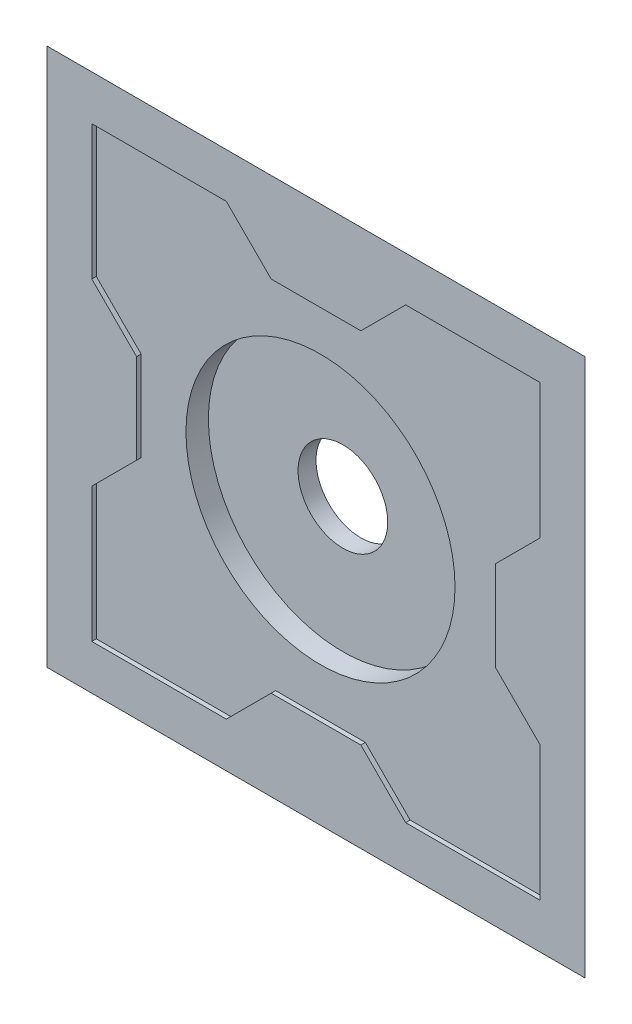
ISO-10303-21;
HEADER;
FILE_DESCRIPTION(('STEP AP214'),'2;1');
FILE_NAME('part.step','',(''),(''),'','','');
FILE_SCHEMA(('AUTOMOTIVE_DESIGN { 1 0 10303 214 1 1 1 1 }'));
ENDSEC;
DATA;
#1=APPLICATION_CONTEXT('core data for automotive mechanical design processes');
#2=APPLICATION_PROTOCOL_DEFINITION('international standard','automotive_design',2000,#1);
#3=PRODUCT_CONTEXT('',#1,'mechanical');
#4=PRODUCT('Part','Part','',(#3));
#5=PRODUCT_RELATED_PRODUCT_CATEGORY('part','',(#4));
#6=PRODUCT_DEFINITION_FORMATION('','',#4);
#7=PRODUCT_DEFINITION_CONTEXT('part definition',#1,'design');
#8=PRODUCT_DEFINITION('design','',#6,#7);
#9=PRODUCT_DEFINITION_SHAPE('','',#8);
#10=(LENGTH_UNIT() NAMED_UNIT(*) SI_UNIT(.MILLI.,.METRE.));
#11=(NAMED_UNIT(*) PLANE_ANGLE_UNIT() SI_UNIT($,.RADIAN.));
#12=(NAMED_UNIT(*) SI_UNIT($,.STERADIAN.) SOLID_ANGLE_UNIT());
#13=UNCERTAINTY_MEASURE_WITH_UNIT(LENGTH_MEASURE(1.E-05),#10,'distance_accuracy_value','');
#14=(GEOMETRIC_REPRESENTATION_CONTEXT(3) GLOBAL_UNCERTAINTY_ASSIGNED_CONTEXT((#13)) GLOBAL_UNIT_ASSIGNED_CONTEXT((#10,
#11,#12)) REPRESENTATION_CONTEXT('',''));
#15=CARTESIAN_POINT('',(0.,0.,0.));
#16=DIRECTION('',(0.,0.,1.));
#17=DIRECTION('',(1.,0.,0.));
#18=AXIS2_PLACEMENT_3D('',#15,#16,#17);
#19=CARTESIAN_POINT('',(0.,0.,10.));
#20=DIRECTION('',(0.,0.,-1.));
#21=DIRECTION('',(-1.,0.,0.));
#22=AXIS2_PLACEMENT_3D('',#19,#20,#21);
#23=PLANE('',#22);
#24=DIRECTION('',(0.707106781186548,-0.707106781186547,0.));
#25=VECTOR('',#24,1.);
#26=CARTESIAN_POINT('',(-50.,20.,10.));
#27=LINE('',#26,#25);
#28=CARTESIAN_POINT('',(-50.,20.,10.));
#29=VERTEX_POINT('',#28);
#30=CARTESIAN_POINT('',(-40.,10.,10.));
#31=VERTEX_POINT('',#30);
#32=EDGE_CURVE('E279',#29,#31,#27,.T.);
#33=ORIENTED_EDGE('',*,*,#32,.F.);
#34=DIRECTION('',(0.,-1.,0.));
#35=VECTOR('',#34,1.);
#36=CARTESIAN_POINT('',(-50.,50.,10.));
#37=LINE('',#36,#35);
#38=CARTESIAN_POINT('',(-50.,50.,10.));
#39=VERTEX_POINT('',#38);
#40=EDGE_CURVE('E202',#39,#29,#37,.T.);
#41=ORIENTED_EDGE('',*,*,#40,.F.);
#42=DIRECTION('',(-1.,0.,0.));
#43=VECTOR('',#42,1.);
#44=CARTESIAN_POINT('',(-50.,50.,10.));
#45=LINE('',#44,#43);
#46=CARTESIAN_POINT('',(-20.,50.,10.));
#47=VERTEX_POINT('',#46);
#48=EDGE_CURVE('E220',#47,#39,#45,.T.);
#49=ORIENTED_EDGE('',*,*,#48,.F.);
#50=DIRECTION('',(-0.707106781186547,0.707106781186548,0.));
#51=VECTOR('',#50,1.);
#52=CARTESIAN_POINT('',(-20.,50.,10.));
#53=LINE('',#52,#51);
#54=CARTESIAN_POINT('',(-10.,40.,10.));
#55=VERTEX_POINT('',#54);
#56=EDGE_CURVE('E223',#55,#47,#53,.T.);
#57=ORIENTED_EDGE('',*,*,#56,.F.);
#58=DIRECTION('',(-1.,0.,0.));
#59=VECTOR('',#58,1.);
#60=CARTESIAN_POINT('',(-10.,40.,10.));
#61=LINE('',#60,#59);
#62=CARTESIAN_POINT('',(9.99999999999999,40.,10.));
#63=VERTEX_POINT('',#62);
#64=EDGE_CURVE('E327',#63,#55,#61,.T.);
#65=ORIENTED_EDGE('',*,*,#64,.F.);
#66=DIRECTION('',(-0.707106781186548,-0.707106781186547,0.));
#67=VECTOR('',#66,1.);
#68=CARTESIAN_POINT('',(9.99999999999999,40.,10.));
#69=LINE('',#68,#67);
#70=CARTESIAN_POINT('',(20.,50.,10.));
#71=VERTEX_POINT('',#70);
#72=EDGE_CURVE('E324',#71,#63,#69,.T.);
#73=ORIENTED_EDGE('',*,*,#72,.F.);
#74=DIRECTION('',(-1.,0.,0.));
#75=VECTOR('',#74,1.);
#76=CARTESIAN_POINT('',(20.,50.,10.));
#77=LINE('',#76,#75);
#78=CARTESIAN_POINT('',(50.,50.,10.));
#79=VERTEX_POINT('',#78);
#80=EDGE_CURVE('E321',#79,#71,#77,.T.);
#81=ORIENTED_EDGE('',*,*,#80,.F.);
#82=DIRECTION('',(0.,1.,0.));
#83=VECTOR('',#82,1.);
#84=CARTESIAN_POINT('',(50.,20.,10.));
#85=LINE('',#84,#83);
#86=CARTESIAN_POINT('',(50.,20.,10.));
#87=VERTEX_POINT('',#86);
#88=EDGE_CURVE('E318',#87,#79,#85,.T.);
#89=ORIENTED_EDGE('',*,*,#88,.F.);
#90=DIRECTION('',(0.707106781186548,0.707106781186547,0.));
#91=VECTOR('',#90,1.);
#92=CARTESIAN_POINT('',(40.,10.,10.));
#93=LINE('',#92,#91);
#94=CARTESIAN_POINT('',(40.,10.,10.));
#95=VERTEX_POINT('',#94);
#96=EDGE_CURVE('E315',#95,#87,#93,.T.);
#97=ORIENTED_EDGE('',*,*,#96,.F.);
#98=DIRECTION('',(0.,1.,0.));
#99=VECTOR('',#98,1.);
#100=CARTESIAN_POINT('',(40.,-10.,10.));
#101=LINE('',#100,#99);
#102=CARTESIAN_POINT('',(40.,-10.,10.));
#103=VERTEX_POINT('',#102);
#104=EDGE_CURVE('E312',#103,#95,#101,.T.);
#105=ORIENTED_EDGE('',*,*,#104,.F.);
#106=DIRECTION('',(-0.707106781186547,0.707106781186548,0.));
#107=VECTOR('',#106,1.);
#108=CARTESIAN_POINT('',(50.,-20.,10.));
#109=LINE('',#108,#107);
#110=CARTESIAN_POINT('',(50.,-20.,10.));
#111=VERTEX_POINT('',#110);
#112=EDGE_CURVE('E309',#111,#103,#109,.T.);
#113=ORIENTED_EDGE('',*,*,#112,.F.);
#114=DIRECTION('',(0.,1.,0.));
#115=VECTOR('',#114,1.);
#116=CARTESIAN_POINT('',(50.,-50.,10.));
#117=LINE('',#116,#115);
#118=CARTESIAN_POINT('',(50.,-50.,10.));
#119=VERTEX_POINT('',#118);
#120=EDGE_CURVE('E306',#119,#111,#117,.T.);
#121=ORIENTED_EDGE('',*,*,#120,.F.);
#122=DIRECTION('',(1.,0.,0.));
#123=VECTOR('',#122,1.);
#124=CARTESIAN_POINT('',(20.,-50.,10.));
#125=LINE('',#124,#123);
#126=CARTESIAN_POINT('',(20.,-50.,10.));
#127=VERTEX_POINT('',#126);
#128=EDGE_CURVE('E303',#127,#119,#125,.T.);
#129=ORIENTED_EDGE('',*,*,#128,.F.);
#130=DIRECTION('',(0.707106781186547,-0.707106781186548,0.));
#131=VECTOR('',#130,1.);
#132=CARTESIAN_POINT('',(9.99999999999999,-40.,10.));
#133=LINE('',#132,#131);
#134=CARTESIAN_POINT('',(9.99999999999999,-40.,10.));
#135=VERTEX_POINT('',#134);
#136=EDGE_CURVE('E300',#135,#127,#133,.T.);
#137=ORIENTED_EDGE('',*,*,#136,.F.);
#138=DIRECTION('',(1.,0.,0.));
#139=VECTOR('',#138,1.);
#140=CARTESIAN_POINT('',(-10.,-40.,10.));
#141=LINE('',#140,#139);
#142=CARTESIAN_POINT('',(-10.,-40.,10.));
#143=VERTEX_POINT('',#142);
#144=EDGE_CURVE('E297',#143,#135,#141,.T.);
#145=ORIENTED_EDGE('',*,*,#144,.F.);
#146=DIRECTION('',(0.707106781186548,0.707106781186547,0.));
#147=VECTOR('',#146,1.);
#148=CARTESIAN_POINT('',(-20.,-50.,10.));
#149=LINE('',#148,#147);
#150=CARTESIAN_POINT('',(-20.,-50.,10.));
#151=VERTEX_POINT('',#150);
#152=EDGE_CURVE('E294',#151,#143,#149,.T.);
#153=ORIENTED_EDGE('',*,*,#152,.F.);
#154=DIRECTION('',(1.,0.,0.));
#155=VECTOR('',#154,1.);
#156=CARTESIAN_POINT('',(-50.,-50.,10.));
#157=LINE('',#156,#155);
#158=CARTESIAN_POINT('',(-50.,-50.,10.));
#159=VERTEX_POINT('',#158);
#160=EDGE_CURVE('E291',#159,#151,#157,.T.);
#161=ORIENTED_EDGE('',*,*,#160,.F.);
#162=DIRECTION('',(0.,-1.,0.));
#163=VECTOR('',#162,1.);
#164=CARTESIAN_POINT('',(-50.,-20.,10.));
#165=LINE('',#164,#163);
#166=CARTESIAN_POINT('',(-50.,-20.,10.));
#167=VERTEX_POINT('',#166);
#168=EDGE_CURVE('E288',#167,#159,#165,.T.);
#169=ORIENTED_EDGE('',*,*,#168,.F.);
#170=DIRECTION('',(-0.707106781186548,-0.707106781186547,0.));
#171=VECTOR('',#170,1.);
#172=CARTESIAN_POINT('',(-40.,-10.,10.));
#173=LINE('',#172,#171);
#174=CARTESIAN_POINT('',(-40.,-10.,10.));
#175=VERTEX_POINT('',#174);
#176=EDGE_CURVE('E285',#175,#167,#173,.T.);
#177=ORIENTED_EDGE('',*,*,#176,.F.);
#178=DIRECTION('',(0.,-1.,0.));
#179=VECTOR('',#178,1.);
#180=CARTESIAN_POINT('',(-40.,10.,10.));
#181=LINE('',#180,#179);
#182=EDGE_CURVE('E282',#31,#175,#181,.T.);
#183=ORIENTED_EDGE('',*,*,#182,.F.);
#184=EDGE_LOOP('',(#33,#41,#49,#57,#65,#73,#81,#89,#97,#105,#113,#121,#129,#137,#145,#153,#161,
#169,#177,#183));
#185=FACE_BOUND('',#184,.T.);
#186=DIRECTION('',(0.,1.,0.));
#187=VECTOR('',#186,1.);
#188=CARTESIAN_POINT('',(60.,-60.,10.));
#189=LINE('',#188,#187);
#190=CARTESIAN_POINT('',(60.,-60.,10.));
#191=VERTEX_POINT('',#190);
#192=CARTESIAN_POINT('',(60.,60.,10.));
#193=VERTEX_POINT('',#192);
#194=EDGE_CURVE('E334',#191,#193,#189,.T.);
#195=ORIENTED_EDGE('',*,*,#194,.T.);
#196=DIRECTION('',(-1.,0.,0.));
#197=VECTOR('',#196,1.);
#198=CARTESIAN_POINT('',(-60.,60.,10.));
#199=LINE('',#198,#197);
#200=CARTESIAN_POINT('',(-60.,60.,10.));
#201=VERTEX_POINT('',#200);
#202=EDGE_CURVE('E372',#193,#201,#199,.T.);
#203=ORIENTED_EDGE('',*,*,#202,.T.);
#204=DIRECTION('',(0.,-1.,0.));
#205=VECTOR('',#204,1.);
#206=CARTESIAN_POINT('',(-60.,-60.,10.));
#207=LINE('',#206,#205);
#208=CARTESIAN_POINT('',(-60.,-60.,10.));
#209=VERTEX_POINT('',#208);
#210=EDGE_CURVE('E374',#201,#209,#207,.T.);
#211=ORIENTED_EDGE('',*,*,#210,.T.);
#212=DIRECTION('',(1.,0.,0.));
#213=VECTOR('',#212,1.);
#214=CARTESIAN_POINT('',(-60.,-60.,10.));
#215=LINE('',#214,#213);
#216=EDGE_CURVE('E376',#209,#191,#215,.T.);
#217=ORIENTED_EDGE('',*,*,#216,.T.);
#218=EDGE_LOOP('',(#195,#203,#211,#217));
#219=FACE_BOUND('',#218,.T.);
#220=ADVANCED_FACE('F32',(#185,#219),#23,.F.);
#221=CARTESIAN_POINT('',(0.,0.,0.));
#222=DIRECTION('',(0.,0.,-1.));
#223=DIRECTION('',(-1.,0.,0.));
#224=AXIS2_PLACEMENT_3D('',#221,#222,#223);
#225=PLANE('',#224);
#226=DIRECTION('',(1.,0.,0.));
#227=VECTOR('',#226,1.);
#228=CARTESIAN_POINT('',(60.,50.,0.));
#229=LINE('',#228,#227);
#230=CARTESIAN_POINT('',(-50.,50.,0.));
#231=VERTEX_POINT('',#230);
#232=CARTESIAN_POINT('',(50.,50.,0.));
#233=VERTEX_POINT('',#232);
#234=EDGE_CURVE('E378',#231,#233,#229,.T.);
#235=ORIENTED_EDGE('',*,*,#234,.T.);
#236=DIRECTION('',(0.,-1.,0.));
#237=VECTOR('',#236,1.);
#238=CARTESIAN_POINT('',(50.,-60.,0.));
#239=LINE('',#238,#237);
#240=CARTESIAN_POINT('',(50.,-50.,0.));
#241=VERTEX_POINT('',#240);
#242=EDGE_CURVE('E11',#233,#241,#239,.T.);
#243=ORIENTED_EDGE('',*,*,#242,.T.);
#244=DIRECTION('',(-1.,0.,0.));
#245=VECTOR('',#244,1.);
#246=CARTESIAN_POINT('',(-60.,-50.,0.));
#247=LINE('',#246,#245);
#248=CARTESIAN_POINT('',(-50.,-50.,0.));
#249=VERTEX_POINT('',#248);
#250=EDGE_CURVE('E41',#241,#249,#247,.T.);
#251=ORIENTED_EDGE('',*,*,#250,.T.);
#252=DIRECTION('',(0.,1.,0.));
#253=VECTOR('',#252,1.);
#254=CARTESIAN_POINT('',(-50.,60.,0.));
#255=LINE('',#254,#253);
#256=EDGE_CURVE('E380',#249,#231,#255,.T.);
#257=ORIENTED_EDGE('',*,*,#256,.T.);
#258=EDGE_LOOP('',(#235,#243,#251,#257));
#259=FACE_BOUND('',#258,.T.);
#260=CARTESIAN_POINT('',(0.,0.,0.));
#261=DIRECTION('',(0.,0.,1.));
#262=DIRECTION('',(1.,0.,0.));
#263=AXIS2_PLACEMENT_3D('',#260,#261,#262);
#264=CIRCLE('',#263,10.);
#265=CARTESIAN_POINT('',(10.,0.,0.));
#266=VERTEX_POINT('',#265);
#267=EDGE_CURVE('E397',#266,#266,#264,.T.);
#268=ORIENTED_EDGE('',*,*,#267,.T.);
#269=EDGE_LOOP('',(#268));
#270=FACE_BOUND('',#269,.T.);
#271=ADVANCED_FACE('F424',(#259,#270),#225,.T.);
#272=CARTESIAN_POINT('',(-50.,50.,9.));
#273=DIRECTION('',(-1.,0.,0.));
#274=DIRECTION('',(0.,0.,1.));
#275=AXIS2_PLACEMENT_3D('',#272,#273,#274);
#276=PLANE('',#275);
#277=ORIENTED_EDGE('',*,*,#40,.T.);
#278=DIRECTION('',(0.,0.,1.));
#279=VECTOR('',#278,1.);
#280=CARTESIAN_POINT('',(-50.,20.,9.));
#281=LINE('',#280,#279);
#282=CARTESIAN_POINT('',(-50.,20.,9.));
#283=VERTEX_POINT('',#282);
#284=EDGE_CURVE('E195',#283,#29,#281,.T.);
#285=ORIENTED_EDGE('',*,*,#284,.F.);
#286=DIRECTION('',(0.,-1.,0.));
#287=VECTOR('',#286,1.);
#288=CARTESIAN_POINT('',(-50.,50.,9.));
#289=LINE('',#288,#287);
#290=CARTESIAN_POINT('',(-50.,50.,9.));
#291=VERTEX_POINT('',#290);
#292=EDGE_CURVE('E199',#291,#283,#289,.T.);
#293=ORIENTED_EDGE('',*,*,#292,.F.);
#294=DIRECTION('',(0.,0.,1.));
#295=VECTOR('',#294,1.);
#296=CARTESIAN_POINT('',(-50.,50.,9.));
#297=LINE('',#296,#295);
#298=EDGE_CURVE('E332',#291,#39,#297,.T.);
#299=ORIENTED_EDGE('',*,*,#298,.T.);
#300=EDGE_LOOP('',(#277,#285,#293,#299));
#301=FACE_BOUND('',#300,.T.);
#302=ADVANCED_FACE('F197',(#301),#276,.F.);
#303=CARTESIAN_POINT('',(-50.,50.,9.));
#304=DIRECTION('',(0.,1.,0.));
#305=DIRECTION('',(0.,0.,1.));
#306=AXIS2_PLACEMENT_3D('',#303,#304,#305);
#307=PLANE('',#306);
#308=ORIENTED_EDGE('',*,*,#48,.T.);
#309=ORIENTED_EDGE('',*,*,#298,.F.);
#310=DIRECTION('',(-1.,0.,0.));
#311=VECTOR('',#310,1.);
#312=CARTESIAN_POINT('',(-50.,50.,9.));
#313=LINE('',#312,#311);
#314=CARTESIAN_POINT('',(-20.,50.,9.));
#315=VERTEX_POINT('',#314);
#316=EDGE_CURVE('E207',#315,#291,#313,.T.);
#317=ORIENTED_EDGE('',*,*,#316,.F.);
#318=DIRECTION('',(0.,0.,1.));
#319=VECTOR('',#318,1.);
#320=CARTESIAN_POINT('',(-20.,50.,9.));
#321=LINE('',#320,#319);
#322=EDGE_CURVE('E335',#315,#47,#321,.T.);
#323=ORIENTED_EDGE('',*,*,#322,.T.);
#324=EDGE_LOOP('',(#308,#309,#317,#323));
#325=FACE_BOUND('',#324,.T.);
#326=ADVANCED_FACE('F646',(#325),#307,.F.);
#327=CARTESIAN_POINT('',(-20.,50.,9.));
#328=DIRECTION('',(0.707106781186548,0.707106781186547,0.));
#329=DIRECTION('',(-0.707106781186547,0.707106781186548,0.));
#330=AXIS2_PLACEMENT_3D('',#327,#328,#329);
#331=PLANE('',#330);
#332=ORIENTED_EDGE('',*,*,#56,.T.);
#333=ORIENTED_EDGE('',*,*,#322,.F.);
#334=DIRECTION('',(-0.707106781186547,0.707106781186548,0.));
#335=VECTOR('',#334,1.);
#336=CARTESIAN_POINT('',(-20.,50.,9.));
#337=LINE('',#336,#335);
#338=CARTESIAN_POINT('',(-10.,40.,9.));
#339=VERTEX_POINT('',#338);
#340=EDGE_CURVE('E275',#339,#315,#337,.T.);
#341=ORIENTED_EDGE('',*,*,#340,.F.);
#342=DIRECTION('',(0.,0.,1.));
#343=VECTOR('',#342,1.);
#344=CARTESIAN_POINT('',(-10.,40.,9.));
#345=LINE('',#344,#343);
#346=EDGE_CURVE('E337',#339,#55,#345,.T.);
#347=ORIENTED_EDGE('',*,*,#346,.T.);
#348=EDGE_LOOP('',(#332,#333,#341,#347));
#349=FACE_BOUND('',#348,.T.);
#350=ADVANCED_FACE('F636',(#349),#331,.F.);
#351=CARTESIAN_POINT('',(-10.,40.,9.));
#352=DIRECTION('',(0.,1.,0.));
#353=DIRECTION('',(-1.,0.,0.));
#354=AXIS2_PLACEMENT_3D('',#351,#352,#353);
#355=PLANE('',#354);
#356=ORIENTED_EDGE('',*,*,#64,.T.);
#357=ORIENTED_EDGE('',*,*,#346,.F.);
#358=DIRECTION('',(-1.,0.,0.));
#359=VECTOR('',#358,1.);
#360=CARTESIAN_POINT('',(-10.,40.,9.));
#361=LINE('',#360,#359);
#362=CARTESIAN_POINT('',(9.99999999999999,40.,9.));
#363=VERTEX_POINT('',#362);
#364=EDGE_CURVE('E272',#363,#339,#361,.T.);
#365=ORIENTED_EDGE('',*,*,#364,.F.);
#366=DIRECTION('',(0.,0.,1.));
#367=VECTOR('',#366,1.);
#368=CARTESIAN_POINT('',(9.99999999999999,40.,9.));
#369=LINE('',#368,#367);
#370=EDGE_CURVE('E339',#363,#63,#369,.T.);
#371=ORIENTED_EDGE('',*,*,#370,.T.);
#372=EDGE_LOOP('',(#356,#357,#365,#371));
#373=FACE_BOUND('',#372,.T.);
#374=ADVANCED_FACE('F626',(#373),#355,.F.);
#375=CARTESIAN_POINT('',(9.99999999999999,40.,9.));
#376=DIRECTION('',(-0.707106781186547,0.707106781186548,0.));
#377=DIRECTION('',(-0.707106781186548,-0.707106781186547,0.));
#378=AXIS2_PLACEMENT_3D('',#375,#376,#377);
#379=PLANE('',#378);
#380=ORIENTED_EDGE('',*,*,#72,.T.);
#381=ORIENTED_EDGE('',*,*,#370,.F.);
#382=DIRECTION('',(-0.707106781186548,-0.707106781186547,0.));
#383=VECTOR('',#382,1.);
#384=CARTESIAN_POINT('',(9.99999999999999,40.,9.));
#385=LINE('',#384,#383);
#386=CARTESIAN_POINT('',(20.,50.,9.));
#387=VERTEX_POINT('',#386);
#388=EDGE_CURVE('E269',#387,#363,#385,.T.);
#389=ORIENTED_EDGE('',*,*,#388,.F.);
#390=DIRECTION('',(0.,0.,1.));
#391=VECTOR('',#390,1.);
#392=CARTESIAN_POINT('',(20.,50.,9.));
#393=LINE('',#392,#391);
#394=EDGE_CURVE('E341',#387,#71,#393,.T.);
#395=ORIENTED_EDGE('',*,*,#394,.T.);
#396=EDGE_LOOP('',(#380,#381,#389,#395));
#397=FACE_BOUND('',#396,.T.);
#398=ADVANCED_FACE('F616',(#397),#379,.F.);
#399=CARTESIAN_POINT('',(20.,50.,9.));
#400=DIRECTION('',(0.,1.,0.));
#401=DIRECTION('',(-1.,0.,0.));
#402=AXIS2_PLACEMENT_3D('',#399,#400,#401);
#403=PLANE('',#402);
#404=ORIENTED_EDGE('',*,*,#80,.T.);
#405=ORIENTED_EDGE('',*,*,#394,.F.);
#406=DIRECTION('',(-1.,0.,0.));
#407=VECTOR('',#406,1.);
#408=CARTESIAN_POINT('',(20.,50.,9.));
#409=LINE('',#408,#407);
#410=CARTESIAN_POINT('',(50.,50.,9.));
#411=VERTEX_POINT('',#410);
#412=EDGE_CURVE('E266',#411,#387,#409,.T.);
#413=ORIENTED_EDGE('',*,*,#412,.F.);
#414=DIRECTION('',(0.,0.,1.));
#415=VECTOR('',#414,1.);
#416=CARTESIAN_POINT('',(50.,50.,9.));
#417=LINE('',#416,#415);
#418=EDGE_CURVE('E343',#411,#79,#417,.T.);
#419=ORIENTED_EDGE('',*,*,#418,.T.);
#420=EDGE_LOOP('',(#404,#405,#413,#419));
#421=FACE_BOUND('',#420,.T.);
#422=ADVANCED_FACE('F606',(#421),#403,.F.);
#423=CARTESIAN_POINT('',(50.,20.,9.));
#424=DIRECTION('',(1.,0.,0.));
#425=DIRECTION('',(0.,0.,-1.));
#426=AXIS2_PLACEMENT_3D('',#423,#424,#425);
#427=PLANE('',#426);
#428=ORIENTED_EDGE('',*,*,#88,.T.);
#429=ORIENTED_EDGE('',*,*,#418,.F.);
#430=DIRECTION('',(0.,1.,0.));
#431=VECTOR('',#430,1.);
#432=CARTESIAN_POINT('',(50.,20.,9.));
#433=LINE('',#432,#431);
#434=CARTESIAN_POINT('',(50.,20.,9.));
#435=VERTEX_POINT('',#434);
#436=EDGE_CURVE('E263',#435,#411,#433,.T.);
#437=ORIENTED_EDGE('',*,*,#436,.F.);
#438=DIRECTION('',(0.,0.,1.));
#439=VECTOR('',#438,1.);
#440=CARTESIAN_POINT('',(50.,20.,9.));
#441=LINE('',#440,#439);
#442=EDGE_CURVE('E345',#435,#87,#441,.T.);
#443=ORIENTED_EDGE('',*,*,#442,.T.);
#444=EDGE_LOOP('',(#428,#429,#437,#443));
#445=FACE_BOUND('',#444,.T.);
#446=ADVANCED_FACE('F596',(#445),#427,.F.);
#447=CARTESIAN_POINT('',(40.,10.,9.));
#448=DIRECTION('',(0.707106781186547,-0.707106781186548,0.));
#449=DIRECTION('',(0.707106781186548,0.707106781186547,0.));
#450=AXIS2_PLACEMENT_3D('',#447,#448,#449);
#451=PLANE('',#450);
#452=ORIENTED_EDGE('',*,*,#96,.T.);
#453=ORIENTED_EDGE('',*,*,#442,.F.);
#454=DIRECTION('',(0.707106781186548,0.707106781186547,0.));
#455=VECTOR('',#454,1.);
#456=CARTESIAN_POINT('',(40.,10.,9.));
#457=LINE('',#456,#455);
#458=CARTESIAN_POINT('',(40.,10.,9.));
#459=VERTEX_POINT('',#458);
#460=EDGE_CURVE('E260',#459,#435,#457,.T.);
#461=ORIENTED_EDGE('',*,*,#460,.F.);
#462=DIRECTION('',(0.,0.,1.));
#463=VECTOR('',#462,1.);
#464=CARTESIAN_POINT('',(40.,10.,9.));
#465=LINE('',#464,#463);
#466=EDGE_CURVE('E347',#459,#95,#465,.T.);
#467=ORIENTED_EDGE('',*,*,#466,.T.);
#468=EDGE_LOOP('',(#452,#453,#461,#467));
#469=FACE_BOUND('',#468,.T.);
#470=ADVANCED_FACE('F586',(#469),#451,.F.);
#471=CARTESIAN_POINT('',(40.,-10.,9.));
#472=DIRECTION('',(1.,0.,0.));
#473=DIRECTION('',(0.,0.,-1.));
#474=AXIS2_PLACEMENT_3D('',#471,#472,#473);
#475=PLANE('',#474);
#476=ORIENTED_EDGE('',*,*,#104,.T.);
#477=ORIENTED_EDGE('',*,*,#466,.F.);
#478=DIRECTION('',(0.,1.,0.));
#479=VECTOR('',#478,1.);
#480=CARTESIAN_POINT('',(40.,-10.,9.));
#481=LINE('',#480,#479);
#482=CARTESIAN_POINT('',(40.,-10.,9.));
#483=VERTEX_POINT('',#482);
#484=EDGE_CURVE('E257',#483,#459,#481,.T.);
#485=ORIENTED_EDGE('',*,*,#484,.F.);
#486=DIRECTION('',(0.,0.,1.));
#487=VECTOR('',#486,1.);
#488=CARTESIAN_POINT('',(40.,-10.,9.));
#489=LINE('',#488,#487);
#490=EDGE_CURVE('E349',#483,#103,#489,.T.);
#491=ORIENTED_EDGE('',*,*,#490,.T.);
#492=EDGE_LOOP('',(#476,#477,#485,#491));
#493=FACE_BOUND('',#492,.T.);
#494=ADVANCED_FACE('F576',(#493),#475,.F.);
#495=CARTESIAN_POINT('',(50.,-20.,9.));
#496=DIRECTION('',(0.707106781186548,0.707106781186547,0.));
#497=DIRECTION('',(-0.707106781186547,0.707106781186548,0.));
#498=AXIS2_PLACEMENT_3D('',#495,#496,#497);
#499=PLANE('',#498);
#500=ORIENTED_EDGE('',*,*,#112,.T.);
#501=ORIENTED_EDGE('',*,*,#490,.F.);
#502=DIRECTION('',(-0.707106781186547,0.707106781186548,0.));
#503=VECTOR('',#502,1.);
#504=CARTESIAN_POINT('',(50.,-20.,9.));
#505=LINE('',#504,#503);
#506=CARTESIAN_POINT('',(50.,-20.,9.));
#507=VERTEX_POINT('',#506);
#508=EDGE_CURVE('E254',#507,#483,#505,.T.);
#509=ORIENTED_EDGE('',*,*,#508,.F.);
#510=DIRECTION('',(0.,0.,1.));
#511=VECTOR('',#510,1.);
#512=CARTESIAN_POINT('',(50.,-20.,9.));
#513=LINE('',#512,#511);
#514=EDGE_CURVE('E351',#507,#111,#513,.T.);
#515=ORIENTED_EDGE('',*,*,#514,.T.);
#516=EDGE_LOOP('',(#500,#501,#509,#515));
#517=FACE_BOUND('',#516,.T.);
#518=ADVANCED_FACE('F566',(#517),#499,.F.);
#519=CARTESIAN_POINT('',(50.,-50.,9.));
#520=DIRECTION('',(1.,0.,0.));
#521=DIRECTION('',(0.,0.,-1.));
#522=AXIS2_PLACEMENT_3D('',#519,#520,#521);
#523=PLANE('',#522);
#524=ORIENTED_EDGE('',*,*,#120,.T.);
#525=ORIENTED_EDGE('',*,*,#514,.F.);
#526=DIRECTION('',(0.,1.,0.));
#527=VECTOR('',#526,1.);
#528=CARTESIAN_POINT('',(50.,-50.,9.));
#529=LINE('',#528,#527);
#530=CARTESIAN_POINT('',(50.,-50.,9.));
#531=VERTEX_POINT('',#530);
#532=EDGE_CURVE('E251',#531,#507,#529,.T.);
#533=ORIENTED_EDGE('',*,*,#532,.F.);
#534=DIRECTION('',(0.,0.,1.));
#535=VECTOR('',#534,1.);
#536=CARTESIAN_POINT('',(50.,-50.,9.));
#537=LINE('',#536,#535);
#538=EDGE_CURVE('E353',#531,#119,#537,.T.);
#539=ORIENTED_EDGE('',*,*,#538,.T.);
#540=EDGE_LOOP('',(#524,#525,#533,#539));
#541=FACE_BOUND('',#540,.T.);
#542=ADVANCED_FACE('F556',(#541),#523,.F.);
#543=CARTESIAN_POINT('',(20.,-50.,9.));
#544=DIRECTION('',(0.,-1.,0.));
#545=DIRECTION('',(0.,0.,-1.));
#546=AXIS2_PLACEMENT_3D('',#543,#544,#545);
#547=PLANE('',#546);
#548=ORIENTED_EDGE('',*,*,#128,.T.);
#549=ORIENTED_EDGE('',*,*,#538,.F.);
#550=DIRECTION('',(1.,0.,0.));
#551=VECTOR('',#550,1.);
#552=CARTESIAN_POINT('',(20.,-50.,9.));
#553=LINE('',#552,#551);
#554=CARTESIAN_POINT('',(20.,-50.,9.));
#555=VERTEX_POINT('',#554);
#556=EDGE_CURVE('E248',#555,#531,#553,.T.);
#557=ORIENTED_EDGE('',*,*,#556,.F.);
#558=DIRECTION('',(0.,0.,1.));
#559=VECTOR('',#558,1.);
#560=CARTESIAN_POINT('',(20.,-50.,9.));
#561=LINE('',#560,#559);
#562=EDGE_CURVE('E355',#555,#127,#561,.T.);
#563=ORIENTED_EDGE('',*,*,#562,.T.);
#564=EDGE_LOOP('',(#548,#549,#557,#563));
#565=FACE_BOUND('',#564,.T.);
#566=ADVANCED_FACE('F546',(#565),#547,.F.);
#567=CARTESIAN_POINT('',(9.99999999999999,-40.,9.));
#568=DIRECTION('',(-0.707106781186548,-0.707106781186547,0.));
#569=DIRECTION('',(0.707106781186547,-0.707106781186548,0.));
#570=AXIS2_PLACEMENT_3D('',#567,#568,#569);
#571=PLANE('',#570);
#572=ORIENTED_EDGE('',*,*,#136,.T.);
#573=ORIENTED_EDGE('',*,*,#562,.F.);
#574=DIRECTION('',(0.707106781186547,-0.707106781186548,0.));
#575=VECTOR('',#574,1.);
#576=CARTESIAN_POINT('',(9.99999999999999,-40.,9.));
#577=LINE('',#576,#575);
#578=CARTESIAN_POINT('',(9.99999999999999,-40.,9.));
#579=VERTEX_POINT('',#578);
#580=EDGE_CURVE('E245',#579,#555,#577,.T.);
#581=ORIENTED_EDGE('',*,*,#580,.F.);
#582=DIRECTION('',(0.,0.,1.));
#583=VECTOR('',#582,1.);
#584=CARTESIAN_POINT('',(9.99999999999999,-40.,9.));
#585=LINE('',#584,#583);
#586=EDGE_CURVE('E357',#579,#135,#585,.T.);
#587=ORIENTED_EDGE('',*,*,#586,.T.);
#588=EDGE_LOOP('',(#572,#573,#581,#587));
#589=FACE_BOUND('',#588,.T.);
#590=ADVANCED_FACE('F536',(#589),#571,.F.);
#591=CARTESIAN_POINT('',(-10.,-40.,9.));
#592=DIRECTION('',(0.,-1.,0.));
#593=DIRECTION('',(0.,0.,-1.));
#594=AXIS2_PLACEMENT_3D('',#591,#592,#593);
#595=PLANE('',#594);
#596=ORIENTED_EDGE('',*,*,#144,.T.);
#597=ORIENTED_EDGE('',*,*,#586,.F.);
#598=DIRECTION('',(1.,0.,0.));
#599=VECTOR('',#598,1.);
#600=CARTESIAN_POINT('',(-10.,-40.,9.));
#601=LINE('',#600,#599);
#602=CARTESIAN_POINT('',(-10.,-40.,9.));
#603=VERTEX_POINT('',#602);
#604=EDGE_CURVE('E242',#603,#579,#601,.T.);
#605=ORIENTED_EDGE('',*,*,#604,.F.);
#606=DIRECTION('',(0.,0.,1.));
#607=VECTOR('',#606,1.);
#608=CARTESIAN_POINT('',(-10.,-40.,9.));
#609=LINE('',#608,#607);
#610=EDGE_CURVE('E359',#603,#143,#609,.T.);
#611=ORIENTED_EDGE('',*,*,#610,.T.);
#612=EDGE_LOOP('',(#596,#597,#605,#611));
#613=FACE_BOUND('',#612,.T.);
#614=ADVANCED_FACE('F526',(#613),#595,.F.);
#615=CARTESIAN_POINT('',(-20.,-50.,9.));
#616=DIRECTION('',(0.707106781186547,-0.707106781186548,0.));
#617=DIRECTION('',(0.707106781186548,0.707106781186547,0.));
#618=AXIS2_PLACEMENT_3D('',#615,#616,#617);
#619=PLANE('',#618);
#620=ORIENTED_EDGE('',*,*,#152,.T.);
#621=ORIENTED_EDGE('',*,*,#610,.F.);
#622=DIRECTION('',(0.707106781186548,0.707106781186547,0.));
#623=VECTOR('',#622,1.);
#624=CARTESIAN_POINT('',(-20.,-50.,9.));
#625=LINE('',#624,#623);
#626=CARTESIAN_POINT('',(-20.,-50.,9.));
#627=VERTEX_POINT('',#626);
#628=EDGE_CURVE('E239',#627,#603,#625,.T.);
#629=ORIENTED_EDGE('',*,*,#628,.F.);
#630=DIRECTION('',(0.,0.,1.));
#631=VECTOR('',#630,1.);
#632=CARTESIAN_POINT('',(-20.,-50.,9.));
#633=LINE('',#632,#631);
#634=EDGE_CURVE('E361',#627,#151,#633,.T.);
#635=ORIENTED_EDGE('',*,*,#634,.T.);
#636=EDGE_LOOP('',(#620,#621,#629,#635));
#637=FACE_BOUND('',#636,.T.);
#638=ADVANCED_FACE('F516',(#637),#619,.F.);
#639=CARTESIAN_POINT('',(-50.,-50.,9.));
#640=DIRECTION('',(0.,-1.,0.));
#641=DIRECTION('',(0.,0.,-1.));
#642=AXIS2_PLACEMENT_3D('',#639,#640,#641);
#643=PLANE('',#642);
#644=ORIENTED_EDGE('',*,*,#160,.T.);
#645=ORIENTED_EDGE('',*,*,#634,.F.);
#646=DIRECTION('',(1.,0.,0.));
#647=VECTOR('',#646,1.);
#648=CARTESIAN_POINT('',(-50.,-50.,9.));
#649=LINE('',#648,#647);
#650=CARTESIAN_POINT('',(-50.,-50.,9.));
#651=VERTEX_POINT('',#650);
#652=EDGE_CURVE('E236',#651,#627,#649,.T.);
#653=ORIENTED_EDGE('',*,*,#652,.F.);
#654=DIRECTION('',(0.,0.,1.));
#655=VECTOR('',#654,1.);
#656=CARTESIAN_POINT('',(-50.,-50.,9.));
#657=LINE('',#656,#655);
#658=EDGE_CURVE('E363',#651,#159,#657,.T.);
#659=ORIENTED_EDGE('',*,*,#658,.T.);
#660=EDGE_LOOP('',(#644,#645,#653,#659));
#661=FACE_BOUND('',#660,.T.);
#662=ADVANCED_FACE('F506',(#661),#643,.F.);
#663=CARTESIAN_POINT('',(-50.,-20.,9.));
#664=DIRECTION('',(-1.,0.,0.));
#665=DIRECTION('',(0.,0.,1.));
#666=AXIS2_PLACEMENT_3D('',#663,#664,#665);
#667=PLANE('',#666);
#668=ORIENTED_EDGE('',*,*,#168,.T.);
#669=ORIENTED_EDGE('',*,*,#658,.F.);
#670=DIRECTION('',(0.,-1.,0.));
#671=VECTOR('',#670,1.);
#672=CARTESIAN_POINT('',(-50.,-20.,9.));
#673=LINE('',#672,#671);
#674=CARTESIAN_POINT('',(-50.,-20.,9.));
#675=VERTEX_POINT('',#674);
#676=EDGE_CURVE('E233',#675,#651,#673,.T.);
#677=ORIENTED_EDGE('',*,*,#676,.F.);
#678=DIRECTION('',(0.,0.,1.));
#679=VECTOR('',#678,1.);
#680=CARTESIAN_POINT('',(-50.,-20.,9.));
#681=LINE('',#680,#679);
#682=EDGE_CURVE('E365',#675,#167,#681,.T.);
#683=ORIENTED_EDGE('',*,*,#682,.T.);
#684=EDGE_LOOP('',(#668,#669,#677,#683));
#685=FACE_BOUND('',#684,.T.);
#686=ADVANCED_FACE('F496',(#685),#667,.F.);
#687=CARTESIAN_POINT('',(-40.,-10.,9.));
#688=DIRECTION('',(-0.707106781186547,0.707106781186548,0.));
#689=DIRECTION('',(-0.707106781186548,-0.707106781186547,0.));
#690=AXIS2_PLACEMENT_3D('',#687,#688,#689);
#691=PLANE('',#690);
#692=ORIENTED_EDGE('',*,*,#176,.T.);
#693=ORIENTED_EDGE('',*,*,#682,.F.);
#694=DIRECTION('',(-0.707106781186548,-0.707106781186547,0.));
#695=VECTOR('',#694,1.);
#696=CARTESIAN_POINT('',(-40.,-10.,9.));
#697=LINE('',#696,#695);
#698=CARTESIAN_POINT('',(-40.,-10.,9.));
#699=VERTEX_POINT('',#698);
#700=EDGE_CURVE('E230',#699,#675,#697,.T.);
#701=ORIENTED_EDGE('',*,*,#700,.F.);
#702=DIRECTION('',(0.,0.,1.));
#703=VECTOR('',#702,1.);
#704=CARTESIAN_POINT('',(-40.,-10.,9.));
#705=LINE('',#704,#703);
#706=EDGE_CURVE('E367',#699,#175,#705,.T.);
#707=ORIENTED_EDGE('',*,*,#706,.T.);
#708=EDGE_LOOP('',(#692,#693,#701,#707));
#709=FACE_BOUND('',#708,.T.);
#710=ADVANCED_FACE('F486',(#709),#691,.F.);
#711=CARTESIAN_POINT('',(-40.,10.,9.));
#712=DIRECTION('',(-1.,0.,0.));
#713=DIRECTION('',(0.,0.,1.));
#714=AXIS2_PLACEMENT_3D('',#711,#712,#713);
#715=PLANE('',#714);
#716=ORIENTED_EDGE('',*,*,#182,.T.);
#717=ORIENTED_EDGE('',*,*,#706,.F.);
#718=DIRECTION('',(0.,-1.,0.));
#719=VECTOR('',#718,1.);
#720=CARTESIAN_POINT('',(-40.,10.,9.));
#721=LINE('',#720,#719);
#722=CARTESIAN_POINT('',(-40.,10.,9.));
#723=VERTEX_POINT('',#722);
#724=EDGE_CURVE('E215',#723,#699,#721,.T.);
#725=ORIENTED_EDGE('',*,*,#724,.F.);
#726=DIRECTION('',(0.,0.,1.));
#727=VECTOR('',#726,1.);
#728=CARTESIAN_POINT('',(-40.,10.,9.));
#729=LINE('',#728,#727);
#730=EDGE_CURVE('E206',#723,#31,#729,.T.);
#731=ORIENTED_EDGE('',*,*,#730,.T.);
#732=EDGE_LOOP('',(#716,#717,#725,#731));
#733=FACE_BOUND('',#732,.T.);
#734=ADVANCED_FACE('F420',(#733),#715,.F.);
#735=CARTESIAN_POINT('',(-50.,20.,9.));
#736=DIRECTION('',(-0.707106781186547,-0.707106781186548,0.));
#737=DIRECTION('',(0.707106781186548,-0.707106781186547,0.));
#738=AXIS2_PLACEMENT_3D('',#735,#736,#737);
#739=PLANE('',#738);
#740=ORIENTED_EDGE('',*,*,#32,.T.);
#741=ORIENTED_EDGE('',*,*,#730,.F.);
#742=DIRECTION('',(0.707106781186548,-0.707106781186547,0.));
#743=VECTOR('',#742,1.);
#744=CARTESIAN_POINT('',(-50.,20.,9.));
#745=LINE('',#744,#743);
#746=EDGE_CURVE('E210',#283,#723,#745,.T.);
#747=ORIENTED_EDGE('',*,*,#746,.F.);
#748=ORIENTED_EDGE('',*,*,#284,.T.);
#749=EDGE_LOOP('',(#740,#741,#747,#748));
#750=FACE_BOUND('',#749,.T.);
#751=ADVANCED_FACE('F211',(#750),#739,.F.);
#752=CARTESIAN_POINT('',(0.,0.,9.));
#753=DIRECTION('',(0.,0.,1.));
#754=DIRECTION('',(1.,0.,0.));
#755=AXIS2_PLACEMENT_3D('',#752,#753,#754);
#756=PLANE('',#755);
#757=CARTESIAN_POINT('',(0.,0.,9.));
#758=DIRECTION('',(0.,0.,1.));
#759=DIRECTION('',(1.,0.,0.));
#760=AXIS2_PLACEMENT_3D('',#757,#758,#759);
#761=CIRCLE('',#760,30.);
#762=CARTESIAN_POINT('',(30.,0.,9.));
#763=VERTEX_POINT('',#762);
#764=EDGE_CURVE('E226',#763,#763,#761,.T.);
#765=ORIENTED_EDGE('',*,*,#764,.F.);
#766=EDGE_LOOP('',(#765));
#767=FACE_BOUND('',#766,.T.);
#768=ORIENTED_EDGE('',*,*,#292,.T.);
#769=ORIENTED_EDGE('',*,*,#746,.T.);
#770=ORIENTED_EDGE('',*,*,#724,.T.);
#771=ORIENTED_EDGE('',*,*,#700,.T.);
#772=ORIENTED_EDGE('',*,*,#676,.T.);
#773=ORIENTED_EDGE('',*,*,#652,.T.);
#774=ORIENTED_EDGE('',*,*,#628,.T.);
#775=ORIENTED_EDGE('',*,*,#604,.T.);
#776=ORIENTED_EDGE('',*,*,#580,.T.);
#777=ORIENTED_EDGE('',*,*,#556,.T.);
#778=ORIENTED_EDGE('',*,*,#532,.T.);
#779=ORIENTED_EDGE('',*,*,#508,.T.);
#780=ORIENTED_EDGE('',*,*,#484,.T.);
#781=ORIENTED_EDGE('',*,*,#460,.T.);
#782=ORIENTED_EDGE('',*,*,#436,.T.);
#783=ORIENTED_EDGE('',*,*,#412,.T.);
#784=ORIENTED_EDGE('',*,*,#388,.T.);
#785=ORIENTED_EDGE('',*,*,#364,.T.);
#786=ORIENTED_EDGE('',*,*,#340,.T.);
#787=ORIENTED_EDGE('',*,*,#316,.T.);
#788=EDGE_LOOP('',(#768,#769,#770,#771,#772,#773,#774,#775,#776,#777,#778,#779,#780,#781,#782,
#783,#784,#785,#786,#787));
#789=FACE_BOUND('',#788,.T.);
#790=ADVANCED_FACE('F217',(#767,#789),#756,.T.);
#791=CARTESIAN_POINT('',(0.,0.,4.));
#792=DIRECTION('',(0.,0.,1.));
#793=DIRECTION('',(1.,0.,0.));
#794=AXIS2_PLACEMENT_3D('',#791,#792,#793);
#795=CYLINDRICAL_SURFACE('',#794,30.);
#796=CARTESIAN_POINT('',(0.,0.,4.));
#797=DIRECTION('',(0.,0.,1.));
#798=DIRECTION('',(1.,0.,0.));
#799=AXIS2_PLACEMENT_3D('',#796,#797,#798);
#800=CIRCLE('',#799,30.);
#801=CARTESIAN_POINT('',(30.,0.,4.));
#802=VERTEX_POINT('',#801);
#803=EDGE_CURVE('E280',#802,#802,#800,.T.);
#804=ORIENTED_EDGE('',*,*,#803,.F.);
#805=EDGE_LOOP('',(#804));
#806=FACE_BOUND('',#805,.T.);
#807=ORIENTED_EDGE('',*,*,#764,.T.);
#808=EDGE_LOOP('',(#807));
#809=FACE_BOUND('',#808,.T.);
#810=ADVANCED_FACE('F409',(#806,#809),#795,.F.);
#811=CARTESIAN_POINT('',(0.,0.,4.));
#812=DIRECTION('',(0.,0.,1.));
#813=DIRECTION('',(1.,0.,0.));
#814=AXIS2_PLACEMENT_3D('',#811,#812,#813);
#815=PLANE('',#814);
#816=CARTESIAN_POINT('',(0.,0.,4.));
#817=DIRECTION('',(0.,0.,1.));
#818=DIRECTION('',(1.,0.,0.));
#819=AXIS2_PLACEMENT_3D('',#816,#817,#818);
#820=CIRCLE('',#819,10.);
#821=CARTESIAN_POINT('',(10.,0.,4.));
#822=VERTEX_POINT('',#821);
#823=EDGE_CURVE('E392',#822,#822,#820,.T.);
#824=ORIENTED_EDGE('',*,*,#823,.F.);
#825=EDGE_LOOP('',(#824));
#826=FACE_BOUND('',#825,.T.);
#827=ORIENTED_EDGE('',*,*,#803,.T.);
#828=EDGE_LOOP('',(#827));
#829=FACE_BOUND('',#828,.T.);
#830=ADVANCED_FACE('F417',(#826,#829),#815,.T.);
#831=CARTESIAN_POINT('',(0.,0.,0.));
#832=DIRECTION('',(0.,0.,1.));
#833=DIRECTION('',(1.,0.,0.));
#834=AXIS2_PLACEMENT_3D('',#831,#832,#833);
#835=CYLINDRICAL_SURFACE('',#834,10.);
#836=ORIENTED_EDGE('',*,*,#267,.F.);
#837=EDGE_LOOP('',(#836));
#838=FACE_BOUND('',#837,.T.);
#839=ORIENTED_EDGE('',*,*,#823,.T.);
#840=EDGE_LOOP('',(#839));
#841=FACE_BOUND('',#840,.T.);
#842=ADVANCED_FACE('F444',(#838,#841),#835,.F.);
#843=CARTESIAN_POINT('',(-60.,-60.,9.99999999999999));
#844=DIRECTION('',(-0.707106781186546,0.,-0.707106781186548));
#845=DIRECTION('',(0.,1.,0.));
#846=AXIS2_PLACEMENT_3D('',#843,#844,#845);
#847=PLANE('',#846);
#848=DIRECTION('',(-0.577350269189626,0.577350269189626,0.577350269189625));
#849=VECTOR('',#848,1.);
#850=CARTESIAN_POINT('',(-60.,60.,9.99999999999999));
#851=LINE('',#850,#849);
#852=EDGE_CURVE('E385',#231,#201,#851,.T.);
#853=ORIENTED_EDGE('',*,*,#852,.F.);
#854=ORIENTED_EDGE('',*,*,#256,.F.);
#855=DIRECTION('',(-0.577350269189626,-0.577350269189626,0.577350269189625));
#856=VECTOR('',#855,1.);
#857=CARTESIAN_POINT('',(-60.,-60.,9.99999999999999));
#858=LINE('',#857,#856);
#859=EDGE_CURVE('E36',#209,#249,#858,.F.);
#860=ORIENTED_EDGE('',*,*,#859,.F.);
#861=ORIENTED_EDGE('',*,*,#210,.F.);
#862=EDGE_LOOP('',(#853,#854,#860,#861));
#863=FACE_BOUND('',#862,.T.);
#864=ADVANCED_FACE('F34',(#863),#847,.T.);
#865=CARTESIAN_POINT('',(-60.,-60.,9.99999999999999));
#866=DIRECTION('',(0.,-0.707106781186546,-0.707106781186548));
#867=DIRECTION('',(-1.,0.,0.));
#868=AXIS2_PLACEMENT_3D('',#865,#866,#867);
#869=PLANE('',#868);
#870=ORIENTED_EDGE('',*,*,#859,.T.);
#871=ORIENTED_EDGE('',*,*,#250,.F.);
#872=DIRECTION('',(0.577350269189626,-0.577350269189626,0.577350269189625));
#873=VECTOR('',#872,1.);
#874=CARTESIAN_POINT('',(19.9999999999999,-19.9999999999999,-30.));
#875=LINE('',#874,#873);
#876=EDGE_CURVE('E49',#191,#241,#875,.F.);
#877=ORIENTED_EDGE('',*,*,#876,.F.);
#878=ORIENTED_EDGE('',*,*,#216,.F.);
#879=EDGE_LOOP('',(#870,#871,#877,#878));
#880=FACE_BOUND('',#879,.T.);
#881=ADVANCED_FACE('F439',(#880),#869,.T.);
#882=CARTESIAN_POINT('',(-60.,60.,9.99999999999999));
#883=DIRECTION('',(0.,0.707106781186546,-0.707106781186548));
#884=DIRECTION('',(1.,0.,0.));
#885=AXIS2_PLACEMENT_3D('',#882,#883,#884);
#886=PLANE('',#885);
#887=ORIENTED_EDGE('',*,*,#852,.T.);
#888=ORIENTED_EDGE('',*,*,#202,.F.);
#889=DIRECTION('',(-0.577350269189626,-0.577350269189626,-0.577350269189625));
#890=VECTOR('',#889,1.);
#891=CARTESIAN_POINT('',(19.9999999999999,19.9999999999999,-30.));
#892=LINE('',#891,#890);
#893=EDGE_CURVE('E383',#233,#193,#892,.F.);
#894=ORIENTED_EDGE('',*,*,#893,.F.);
#895=ORIENTED_EDGE('',*,*,#234,.F.);
#896=EDGE_LOOP('',(#887,#888,#894,#895));
#897=FACE_BOUND('',#896,.T.);
#898=ADVANCED_FACE('F437',(#897),#886,.T.);
#899=CARTESIAN_POINT('',(60.,-60.,9.99999999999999));
#900=DIRECTION('',(0.707106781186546,0.,-0.707106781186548));
#901=DIRECTION('',(0.,-1.,0.));
#902=AXIS2_PLACEMENT_3D('',#899,#900,#901);
#903=PLANE('',#902);
#904=ORIENTED_EDGE('',*,*,#876,.T.);
#905=ORIENTED_EDGE('',*,*,#242,.F.);
#906=ORIENTED_EDGE('',*,*,#893,.T.);
#907=ORIENTED_EDGE('',*,*,#194,.F.);
#908=EDGE_LOOP('',(#904,#905,#906,#907));
#909=FACE_BOUND('',#908,.T.);
#910=ADVANCED_FACE('F434',(#909),#903,.T.);
#911=CLOSED_SHELL('',(#220,#271,#302,#326,#350,#374,#398,#422,#446,#470,#494,#518,#542,#566,
#590,#614,#638,#662,#686,#710,#734,#751,#790,#810,#830,#842,#864,#881,#898,#910));
#912=MANIFOLD_SOLID_BREP('B2',#911);
#913=ADVANCED_BREP_SHAPE_REPRESENTATION('',(#18,#912),#14);
#914=SHAPE_DEFINITION_REPRESENTATION(#9,#913);
ENDSEC;
END-ISO-10303-21;
